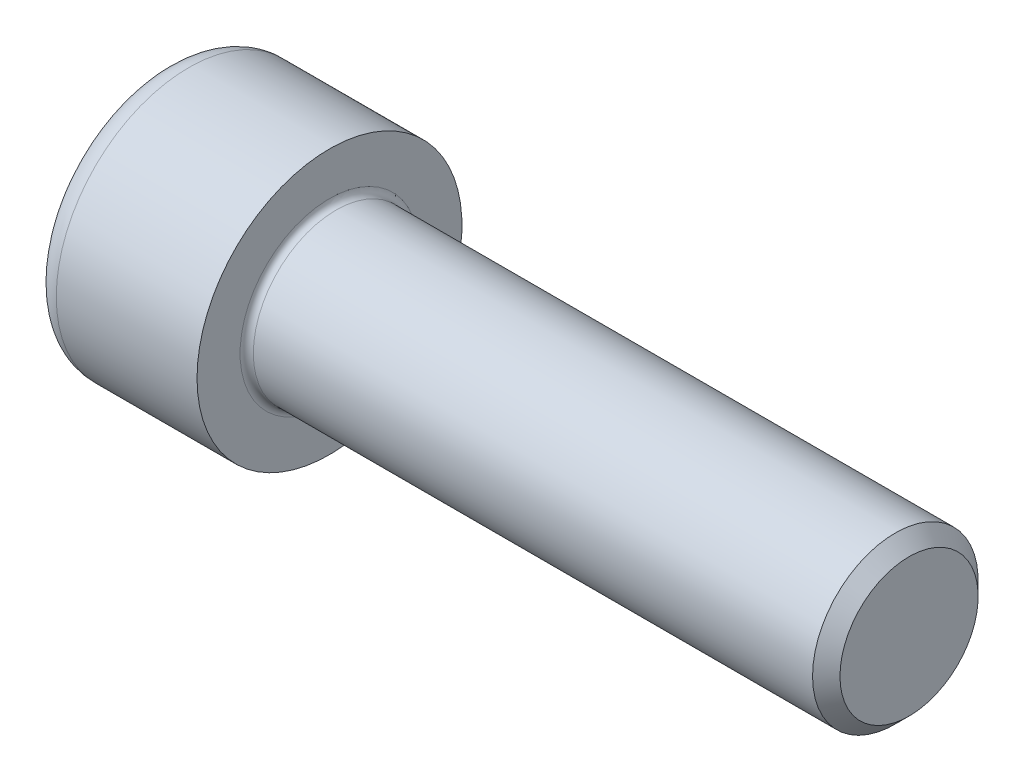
ISO-10303-21;
HEADER;
FILE_DESCRIPTION(('STEP AP214'),'2;1');
FILE_NAME('part.step','',(''),(''),'','','');
FILE_SCHEMA(('AUTOMOTIVE_DESIGN { 1 0 10303 214 1 1 1 1 }'));
ENDSEC;
DATA;
#1=APPLICATION_CONTEXT('core data for automotive mechanical design processes');
#2=APPLICATION_PROTOCOL_DEFINITION('international standard','automotive_design',2000,#1);
#3=PRODUCT_CONTEXT('',#1,'mechanical');
#4=PRODUCT('Part','Part','',(#3));
#5=PRODUCT_RELATED_PRODUCT_CATEGORY('part','',(#4));
#6=PRODUCT_DEFINITION_FORMATION('','',#4);
#7=PRODUCT_DEFINITION_CONTEXT('part definition',#1,'design');
#8=PRODUCT_DEFINITION('design','',#6,#7);
#9=PRODUCT_DEFINITION_SHAPE('','',#8);
#10=(LENGTH_UNIT() NAMED_UNIT(*) SI_UNIT(.MILLI.,.METRE.));
#11=(NAMED_UNIT(*) PLANE_ANGLE_UNIT() SI_UNIT($,.RADIAN.));
#12=(NAMED_UNIT(*) SI_UNIT($,.STERADIAN.) SOLID_ANGLE_UNIT());
#13=UNCERTAINTY_MEASURE_WITH_UNIT(LENGTH_MEASURE(1.E-05),#10,'distance_accuracy_value','');
#14=(GEOMETRIC_REPRESENTATION_CONTEXT(3) GLOBAL_UNCERTAINTY_ASSIGNED_CONTEXT((#13)) GLOBAL_UNIT_ASSIGNED_CONTEXT((#10,
#11,#12)) REPRESENTATION_CONTEXT('',''));
#15=CARTESIAN_POINT('',(0.,0.,0.));
#16=DIRECTION('',(0.,0.,1.));
#17=DIRECTION('',(1.,0.,0.));
#18=AXIS2_PLACEMENT_3D('',#15,#16,#17);
#19=CARTESIAN_POINT('',(0.,0.,0.));
#20=DIRECTION('',(-1.,0.,0.));
#21=DIRECTION('',(0.,0.,1.));
#22=AXIS2_PLACEMENT_3D('',#19,#20,#21);
#23=PLANE('',#22);
#24=DIRECTION('',(0.,-0.499999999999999,0.866025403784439));
#25=VECTOR('',#24,1.);
#26=CARTESIAN_POINT('',(0.,4.68519743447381,0.));
#27=LINE('',#26,#25);
#28=CARTESIAN_POINT('',(0.,4.68519743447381,0.));
#29=VERTEX_POINT('',#28);
#30=CARTESIAN_POINT('',(0.,2.34259871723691,4.05749999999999));
#31=VERTEX_POINT('',#30);
#32=EDGE_CURVE('E115',#29,#31,#27,.T.);
#33=ORIENTED_EDGE('',*,*,#32,.T.);
#34=DIRECTION('',(0.,1.,0.));
#35=VECTOR('',#34,1.);
#36=CARTESIAN_POINT('',(0.,-2.3425987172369,4.0575));
#37=LINE('',#36,#35);
#38=CARTESIAN_POINT('',(0.,-2.3425987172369,4.0575));
#39=VERTEX_POINT('',#38);
#40=EDGE_CURVE('E104',#39,#31,#37,.T.);
#41=ORIENTED_EDGE('',*,*,#40,.F.);
#42=DIRECTION('',(0.,-0.500000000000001,-0.866025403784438));
#43=VECTOR('',#42,1.);
#44=CARTESIAN_POINT('',(0.,-2.3425987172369,4.0575));
#45=LINE('',#44,#43);
#46=CARTESIAN_POINT('',(0.,-4.68519743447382,0.));
#47=VERTEX_POINT('',#46);
#48=EDGE_CURVE('E114',#39,#47,#45,.T.);
#49=ORIENTED_EDGE('',*,*,#48,.T.);
#50=DIRECTION('',(0.,0.499999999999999,-0.866025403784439));
#51=VECTOR('',#50,1.);
#52=CARTESIAN_POINT('',(0.,-4.68519743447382,0.));
#53=LINE('',#52,#51);
#54=CARTESIAN_POINT('',(0.,-2.34259871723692,-4.0575));
#55=VERTEX_POINT('',#54);
#56=EDGE_CURVE('E133',#47,#55,#53,.T.);
#57=ORIENTED_EDGE('',*,*,#56,.T.);
#58=DIRECTION('',(0.,-1.,0.));
#59=VECTOR('',#58,1.);
#60=CARTESIAN_POINT('',(0.,2.3425987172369,-4.05750000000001));
#61=LINE('',#60,#59);
#62=CARTESIAN_POINT('',(0.,2.3425987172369,-4.05750000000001));
#63=VERTEX_POINT('',#62);
#64=EDGE_CURVE('E136',#63,#55,#61,.T.);
#65=ORIENTED_EDGE('',*,*,#64,.F.);
#66=DIRECTION('',(0.,-0.500000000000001,-0.866025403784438));
#67=VECTOR('',#66,1.);
#68=CARTESIAN_POINT('',(0.,4.68519743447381,0.));
#69=LINE('',#68,#67);
#70=EDGE_CURVE('E129',#29,#63,#69,.T.);
#71=ORIENTED_EDGE('',*,*,#70,.F.);
#72=EDGE_LOOP('',(#33,#41,#49,#57,#65,#71));
#73=FACE_BOUND('',#72,.T.);
#74=CARTESIAN_POINT('',(0.,0.,0.));
#75=DIRECTION('',(-1.,0.,0.));
#76=DIRECTION('',(0.,0.,1.));
#77=AXIS2_PLACEMENT_3D('',#74,#75,#76);
#78=CIRCLE('',#77,6.5);
#79=CARTESIAN_POINT('',(0.,0.,6.5));
#80=VERTEX_POINT('',#79);
#81=EDGE_CURVE('E40',#80,#80,#78,.T.);
#82=ORIENTED_EDGE('',*,*,#81,.T.);
#83=EDGE_LOOP('',(#82));
#84=FACE_BOUND('',#83,.T.);
#85=ADVANCED_FACE('F33',(#73,#84),#23,.T.);
#86=CARTESIAN_POINT('',(-31.75,0.,0.));
#87=DIRECTION('',(-1.,0.,0.));
#88=DIRECTION('',(0.,0.,1.));
#89=AXIS2_PLACEMENT_3D('',#86,#87,#88);
#90=CYLINDRICAL_SURFACE('',#89,8.);
#91=CARTESIAN_POINT('',(1.5,0.,0.));
#92=DIRECTION('',(-1.,0.,0.));
#93=DIRECTION('',(0.,0.,1.));
#94=AXIS2_PLACEMENT_3D('',#91,#92,#93);
#95=CIRCLE('',#94,8.);
#96=CARTESIAN_POINT('',(1.5,0.,8.));
#97=VERTEX_POINT('',#96);
#98=EDGE_CURVE('E11',#97,#97,#95,.F.);
#99=ORIENTED_EDGE('',*,*,#98,.T.);
#100=EDGE_LOOP('',(#99));
#101=FACE_BOUND('',#100,.T.);
#102=CARTESIAN_POINT('',(10.,0.,0.));
#103=DIRECTION('',(-1.,0.,0.));
#104=DIRECTION('',(0.,0.,1.));
#105=AXIS2_PLACEMENT_3D('',#102,#103,#104);
#106=CIRCLE('',#105,8.);
#107=CARTESIAN_POINT('',(10.,0.,8.));
#108=VERTEX_POINT('',#107);
#109=EDGE_CURVE('E181',#108,#108,#106,.T.);
#110=ORIENTED_EDGE('',*,*,#109,.T.);
#111=EDGE_LOOP('',(#110));
#112=FACE_BOUND('',#111,.T.);
#113=ADVANCED_FACE('F208',(#101,#112),#90,.T.);
#114=CARTESIAN_POINT('',(10.,8.,0.));
#115=DIRECTION('',(1.,0.,0.));
#116=DIRECTION('',(0.,0.,-1.));
#117=AXIS2_PLACEMENT_3D('',#114,#115,#116);
#118=PLANE('',#117);
#119=CARTESIAN_POINT('',(10.,0.,0.));
#120=DIRECTION('',(1.,0.,0.));
#121=DIRECTION('',(0.,0.,-1.));
#122=AXIS2_PLACEMENT_3D('',#119,#120,#121);
#123=CIRCLE('',#122,5.4);
#124=CARTESIAN_POINT('',(10.,0.,-5.4));
#125=VERTEX_POINT('',#124);
#126=EDGE_CURVE('E184',#125,#125,#123,.F.);
#127=ORIENTED_EDGE('',*,*,#126,.T.);
#128=EDGE_LOOP('',(#127));
#129=FACE_BOUND('',#128,.T.);
#130=ORIENTED_EDGE('',*,*,#109,.F.);
#131=EDGE_LOOP('',(#130));
#132=FACE_BOUND('',#131,.T.);
#133=ADVANCED_FACE('F212',(#129,#132),#118,.T.);
#134=CARTESIAN_POINT('',(-31.75,0.,0.));
#135=DIRECTION('',(-1.,0.,0.));
#136=DIRECTION('',(0.,0.,1.));
#137=AXIS2_PLACEMENT_3D('',#134,#135,#136);
#138=CYLINDRICAL_SURFACE('',#137,5.);
#139=CARTESIAN_POINT('',(10.4,0.,0.));
#140=DIRECTION('',(1.,0.,0.));
#141=DIRECTION('',(0.,0.,-1.));
#142=AXIS2_PLACEMENT_3D('',#139,#140,#141);
#143=CIRCLE('',#142,5.);
#144=CARTESIAN_POINT('',(10.4,0.,-5.));
#145=VERTEX_POINT('',#144);
#146=EDGE_CURVE('E187',#145,#145,#143,.T.);
#147=ORIENTED_EDGE('',*,*,#146,.T.);
#148=EDGE_LOOP('',(#147));
#149=FACE_BOUND('',#148,.T.);
#150=CARTESIAN_POINT('',(44.172,0.,0.));
#151=DIRECTION('',(-1.,0.,0.));
#152=DIRECTION('',(0.,0.,1.));
#153=AXIS2_PLACEMENT_3D('',#150,#151,#152);
#154=CIRCLE('',#153,5.);
#155=CARTESIAN_POINT('',(44.172,0.,5.));
#156=VERTEX_POINT('',#155);
#157=EDGE_CURVE('E178',#156,#156,#154,.T.);
#158=ORIENTED_EDGE('',*,*,#157,.T.);
#159=EDGE_LOOP('',(#158));
#160=FACE_BOUND('',#159,.T.);
#161=ADVANCED_FACE('F217',(#149,#160),#138,.T.);
#162=CARTESIAN_POINT('',(45.,0.,0.));
#163=DIRECTION('',(-1.,0.,0.));
#164=DIRECTION('',(0.,0.,1.));
#165=AXIS2_PLACEMENT_3D('',#162,#163,#164);
#166=CONICAL_SURFACE('',#165,4.172,0.785398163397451);
#167=ORIENTED_EDGE('',*,*,#157,.F.);
#168=EDGE_LOOP('',(#167));
#169=FACE_BOUND('',#168,.T.);
#170=CARTESIAN_POINT('',(45.,0.,0.));
#171=DIRECTION('',(-1.,0.,0.));
#172=DIRECTION('',(0.,0.,1.));
#173=AXIS2_PLACEMENT_3D('',#170,#171,#172);
#174=CIRCLE('',#173,4.172);
#175=CARTESIAN_POINT('',(45.,0.,4.172));
#176=VERTEX_POINT('',#175);
#177=EDGE_CURVE('E174',#176,#176,#174,.T.);
#178=ORIENTED_EDGE('',*,*,#177,.T.);
#179=EDGE_LOOP('',(#178));
#180=FACE_BOUND('',#179,.T.);
#181=ADVANCED_FACE('F224',(#169,#180),#166,.T.);
#182=CARTESIAN_POINT('',(45.,4.172,0.));
#183=DIRECTION('',(1.,0.,0.));
#184=DIRECTION('',(0.,0.,-1.));
#185=AXIS2_PLACEMENT_3D('',#182,#183,#184);
#186=PLANE('',#185);
#187=ORIENTED_EDGE('',*,*,#177,.F.);
#188=EDGE_LOOP('',(#187));
#189=FACE_BOUND('',#188,.T.);
#190=ADVANCED_FACE('F202',(#189),#186,.T.);
#191=CARTESIAN_POINT('',(10.4,0.,0.));
#192=DIRECTION('',(1.,0.,0.));
#193=DIRECTION('',(0.,0.,-1.));
#194=AXIS2_PLACEMENT_3D('',#191,#192,#193);
#195=TOROIDAL_SURFACE('',#194,5.4,0.4);
#196=ORIENTED_EDGE('',*,*,#146,.F.);
#197=EDGE_LOOP('',(#196));
#198=FACE_BOUND('',#197,.T.);
#199=ORIENTED_EDGE('',*,*,#126,.F.);
#200=EDGE_LOOP('',(#199));
#201=FACE_BOUND('',#200,.T.);
#202=ADVANCED_FACE('F194',(#198,#201),#195,.F.);
#203=CARTESIAN_POINT('',(1.5,0.,0.));
#204=DIRECTION('',(-1.,0.,0.));
#205=DIRECTION('',(0.,0.,1.));
#206=AXIS2_PLACEMENT_3D('',#203,#204,#205);
#207=TOROIDAL_SURFACE('',#206,6.5,1.5);
#208=ORIENTED_EDGE('',*,*,#98,.F.);
#209=EDGE_LOOP('',(#208));
#210=FACE_BOUND('',#209,.T.);
#211=ORIENTED_EDGE('',*,*,#81,.F.);
#212=EDGE_LOOP('',(#211));
#213=FACE_BOUND('',#212,.T.);
#214=ADVANCED_FACE('F192',(#210,#213),#207,.T.);
#215=CARTESIAN_POINT('',(5.,4.68519743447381,0.));
#216=DIRECTION('',(0.,-0.866025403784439,-0.499999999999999));
#217=DIRECTION('',(0.,0.499999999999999,-0.866025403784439));
#218=AXIS2_PLACEMENT_3D('',#215,#216,#217);
#219=PLANE('',#218);
#220=ORIENTED_EDGE('',*,*,#32,.F.);
#221=DIRECTION('',(-1.,0.,0.));
#222=VECTOR('',#221,1.);
#223=CARTESIAN_POINT('',(5.,4.68519743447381,0.));
#224=LINE('',#223,#222);
#225=CARTESIAN_POINT('',(5.,4.68519743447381,0.));
#226=VERTEX_POINT('',#225);
#227=EDGE_CURVE('E159',#226,#29,#224,.T.);
#228=ORIENTED_EDGE('',*,*,#227,.F.);
#229=DIRECTION('',(0.,-0.499999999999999,0.866025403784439));
#230=VECTOR('',#229,1.);
#231=CARTESIAN_POINT('',(5.,4.68519743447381,0.));
#232=LINE('',#231,#230);
#233=CARTESIAN_POINT('',(5.,3.51389807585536,2.02874999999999));
#234=VERTEX_POINT('',#233);
#235=EDGE_CURVE('E139',#226,#234,#232,.T.);
#236=ORIENTED_EDGE('',*,*,#235,.T.);
#237=CARTESIAN_POINT('',(5.,2.34259871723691,4.05749999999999));
#238=VERTEX_POINT('',#237);
#239=EDGE_CURVE('E123',#234,#238,#232,.T.);
#240=ORIENTED_EDGE('',*,*,#239,.T.);
#241=DIRECTION('',(-1.,0.,0.));
#242=VECTOR('',#241,1.);
#243=CARTESIAN_POINT('',(5.,2.34259871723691,4.05749999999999));
#244=LINE('',#243,#242);
#245=EDGE_CURVE('E108',#238,#31,#244,.T.);
#246=ORIENTED_EDGE('',*,*,#245,.T.);
#247=EDGE_LOOP('',(#220,#228,#236,#240,#246));
#248=FACE_BOUND('',#247,.T.);
#249=ADVANCED_FACE('F119',(#248),#219,.T.);
#250=CARTESIAN_POINT('',(5.,-2.3425987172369,4.0575));
#251=DIRECTION('',(0.,0.,1.));
#252=DIRECTION('',(0.,-1.,0.));
#253=AXIS2_PLACEMENT_3D('',#250,#251,#252);
#254=PLANE('',#253);
#255=ORIENTED_EDGE('',*,*,#40,.T.);
#256=ORIENTED_EDGE('',*,*,#245,.F.);
#257=DIRECTION('',(0.,1.,0.));
#258=VECTOR('',#257,1.);
#259=CARTESIAN_POINT('',(5.,-2.3425987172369,4.0575));
#260=LINE('',#259,#258);
#261=CARTESIAN_POINT('',(5.,0.,4.0575));
#262=VERTEX_POINT('',#261);
#263=EDGE_CURVE('E141',#262,#238,#260,.T.);
#264=ORIENTED_EDGE('',*,*,#263,.F.);
#265=CARTESIAN_POINT('',(5.,-2.3425987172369,4.0575));
#266=VERTEX_POINT('',#265);
#267=EDGE_CURVE('E142',#266,#262,#260,.T.);
#268=ORIENTED_EDGE('',*,*,#267,.F.);
#269=DIRECTION('',(-1.,0.,0.));
#270=VECTOR('',#269,1.);
#271=CARTESIAN_POINT('',(5.,-2.3425987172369,4.0575));
#272=LINE('',#271,#270);
#273=EDGE_CURVE('E110',#266,#39,#272,.T.);
#274=ORIENTED_EDGE('',*,*,#273,.T.);
#275=EDGE_LOOP('',(#255,#256,#264,#268,#274));
#276=FACE_BOUND('',#275,.T.);
#277=ADVANCED_FACE('F106',(#276),#254,.F.);
#278=CARTESIAN_POINT('',(5.,-2.3425987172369,4.0575));
#279=DIRECTION('',(0.,0.866025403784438,-0.500000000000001));
#280=DIRECTION('',(0.,0.500000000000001,0.866025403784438));
#281=AXIS2_PLACEMENT_3D('',#278,#279,#280);
#282=PLANE('',#281);
#283=ORIENTED_EDGE('',*,*,#48,.F.);
#284=ORIENTED_EDGE('',*,*,#273,.F.);
#285=DIRECTION('',(0.,-0.500000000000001,-0.866025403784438));
#286=VECTOR('',#285,1.);
#287=CARTESIAN_POINT('',(5.,-2.3425987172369,4.0575));
#288=LINE('',#287,#286);
#289=CARTESIAN_POINT('',(5.,-3.51389807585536,2.02875));
#290=VERTEX_POINT('',#289);
#291=EDGE_CURVE('E146',#266,#290,#288,.T.);
#292=ORIENTED_EDGE('',*,*,#291,.T.);
#293=CARTESIAN_POINT('',(5.,-4.68519743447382,0.));
#294=VERTEX_POINT('',#293);
#295=EDGE_CURVE('E145',#290,#294,#288,.T.);
#296=ORIENTED_EDGE('',*,*,#295,.T.);
#297=DIRECTION('',(-1.,0.,0.));
#298=VECTOR('',#297,1.);
#299=CARTESIAN_POINT('',(5.,-4.68519743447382,0.));
#300=LINE('',#299,#298);
#301=EDGE_CURVE('E167',#294,#47,#300,.T.);
#302=ORIENTED_EDGE('',*,*,#301,.T.);
#303=EDGE_LOOP('',(#283,#284,#292,#296,#302));
#304=FACE_BOUND('',#303,.T.);
#305=ADVANCED_FACE('F274',(#304),#282,.T.);
#306=CARTESIAN_POINT('',(5.,-4.68519743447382,0.));
#307=DIRECTION('',(0.,0.866025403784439,0.499999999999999));
#308=DIRECTION('',(0.,-0.499999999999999,0.866025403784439));
#309=AXIS2_PLACEMENT_3D('',#306,#307,#308);
#310=PLANE('',#309);
#311=ORIENTED_EDGE('',*,*,#56,.F.);
#312=ORIENTED_EDGE('',*,*,#301,.F.);
#313=DIRECTION('',(0.,0.499999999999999,-0.866025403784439));
#314=VECTOR('',#313,1.);
#315=CARTESIAN_POINT('',(5.,-4.68519743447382,0.));
#316=LINE('',#315,#314);
#317=CARTESIAN_POINT('',(5.,-3.51389807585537,-2.02875));
#318=VERTEX_POINT('',#317);
#319=EDGE_CURVE('E150',#294,#318,#316,.T.);
#320=ORIENTED_EDGE('',*,*,#319,.T.);
#321=CARTESIAN_POINT('',(5.,-2.34259871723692,-4.0575));
#322=VERTEX_POINT('',#321);
#323=EDGE_CURVE('E149',#318,#322,#316,.T.);
#324=ORIENTED_EDGE('',*,*,#323,.T.);
#325=DIRECTION('',(-1.,0.,0.));
#326=VECTOR('',#325,1.);
#327=CARTESIAN_POINT('',(5.,-2.34259871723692,-4.0575));
#328=LINE('',#327,#326);
#329=EDGE_CURVE('E164',#322,#55,#328,.T.);
#330=ORIENTED_EDGE('',*,*,#329,.T.);
#331=EDGE_LOOP('',(#311,#312,#320,#324,#330));
#332=FACE_BOUND('',#331,.T.);
#333=ADVANCED_FACE('F283',(#332),#310,.T.);
#334=CARTESIAN_POINT('',(5.,2.3425987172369,-4.05750000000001));
#335=DIRECTION('',(0.,0.,-1.));
#336=DIRECTION('',(0.,1.,0.));
#337=AXIS2_PLACEMENT_3D('',#334,#335,#336);
#338=PLANE('',#337);
#339=ORIENTED_EDGE('',*,*,#64,.T.);
#340=ORIENTED_EDGE('',*,*,#329,.F.);
#341=DIRECTION('',(0.,-1.,0.));
#342=VECTOR('',#341,1.);
#343=CARTESIAN_POINT('',(5.,2.3425987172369,-4.05750000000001));
#344=LINE('',#343,#342);
#345=CARTESIAN_POINT('',(5.,0.,-4.0575));
#346=VERTEX_POINT('',#345);
#347=EDGE_CURVE('E153',#346,#322,#344,.T.);
#348=ORIENTED_EDGE('',*,*,#347,.F.);
#349=CARTESIAN_POINT('',(5.,2.3425987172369,-4.05750000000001));
#350=VERTEX_POINT('',#349);
#351=EDGE_CURVE('E47',#350,#346,#344,.T.);
#352=ORIENTED_EDGE('',*,*,#351,.F.);
#353=DIRECTION('',(-1.,0.,0.));
#354=VECTOR('',#353,1.);
#355=CARTESIAN_POINT('',(5.,2.3425987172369,-4.05750000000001));
#356=LINE('',#355,#354);
#357=EDGE_CURVE('E161',#350,#63,#356,.T.);
#358=ORIENTED_EDGE('',*,*,#357,.T.);
#359=EDGE_LOOP('',(#339,#340,#348,#352,#358));
#360=FACE_BOUND('',#359,.T.);
#361=ADVANCED_FACE('F293',(#360),#338,.F.);
#362=CARTESIAN_POINT('',(5.,4.68519743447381,0.));
#363=DIRECTION('',(0.,0.866025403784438,-0.500000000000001));
#364=DIRECTION('',(0.,0.500000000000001,0.866025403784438));
#365=AXIS2_PLACEMENT_3D('',#362,#363,#364);
#366=PLANE('',#365);
#367=ORIENTED_EDGE('',*,*,#70,.T.);
#368=ORIENTED_EDGE('',*,*,#357,.F.);
#369=DIRECTION('',(0.,-0.500000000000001,-0.866025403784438));
#370=VECTOR('',#369,1.);
#371=CARTESIAN_POINT('',(5.,4.68519743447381,0.));
#372=LINE('',#371,#370);
#373=CARTESIAN_POINT('',(5.,3.51389807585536,-2.02875));
#374=VERTEX_POINT('',#373);
#375=EDGE_CURVE('E155',#374,#350,#372,.T.);
#376=ORIENTED_EDGE('',*,*,#375,.F.);
#377=EDGE_CURVE('E156',#226,#374,#372,.T.);
#378=ORIENTED_EDGE('',*,*,#377,.F.);
#379=ORIENTED_EDGE('',*,*,#227,.T.);
#380=EDGE_LOOP('',(#367,#368,#376,#378,#379));
#381=FACE_BOUND('',#380,.T.);
#382=ADVANCED_FACE('F303',(#381),#366,.F.);
#383=CARTESIAN_POINT('',(5.,4.68519743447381,0.));
#384=DIRECTION('',(1.,0.,0.));
#385=DIRECTION('',(0.,0.,-1.));
#386=AXIS2_PLACEMENT_3D('',#383,#384,#385);
#387=PLANE('',#386);
#388=ORIENTED_EDGE('',*,*,#347,.T.);
#389=ORIENTED_EDGE('',*,*,#323,.F.);
#390=CARTESIAN_POINT('',(5.,0.,0.));
#391=DIRECTION('',(-1.,0.,0.));
#392=DIRECTION('',(0.,0.,1.));
#393=AXIS2_PLACEMENT_3D('',#390,#391,#392);
#394=CIRCLE('',#393,4.0575);
#395=EDGE_CURVE('E389',#346,#318,#394,.T.);
#396=ORIENTED_EDGE('',*,*,#395,.F.);
#397=EDGE_LOOP('',(#388,#389,#396));
#398=FACE_BOUND('',#397,.T.);
#399=ADVANCED_FACE('F313',(#398),#387,.F.);
#400=ORIENTED_EDGE('',*,*,#319,.F.);
#401=ORIENTED_EDGE('',*,*,#295,.F.);
#402=EDGE_CURVE('E387',#318,#290,#394,.T.);
#403=ORIENTED_EDGE('',*,*,#402,.F.);
#404=EDGE_LOOP('',(#400,#401,#403));
#405=FACE_BOUND('',#404,.T.);
#406=ADVANCED_FACE('F323',(#405),#387,.F.);
#407=ORIENTED_EDGE('',*,*,#291,.F.);
#408=ORIENTED_EDGE('',*,*,#267,.T.);
#409=EDGE_CURVE('E124',#290,#262,#394,.T.);
#410=ORIENTED_EDGE('',*,*,#409,.F.);
#411=EDGE_LOOP('',(#407,#408,#410));
#412=FACE_BOUND('',#411,.T.);
#413=ADVANCED_FACE('F334',(#412),#387,.F.);
#414=ORIENTED_EDGE('',*,*,#263,.T.);
#415=ORIENTED_EDGE('',*,*,#239,.F.);
#416=EDGE_CURVE('E171',#262,#234,#394,.T.);
#417=ORIENTED_EDGE('',*,*,#416,.F.);
#418=EDGE_LOOP('',(#414,#415,#417));
#419=FACE_BOUND('',#418,.T.);
#420=ADVANCED_FACE('F343',(#419),#387,.F.);
#421=ORIENTED_EDGE('',*,*,#235,.F.);
#422=ORIENTED_EDGE('',*,*,#377,.T.);
#423=EDGE_CURVE('E175',#234,#374,#394,.T.);
#424=ORIENTED_EDGE('',*,*,#423,.F.);
#425=EDGE_LOOP('',(#421,#422,#424));
#426=FACE_BOUND('',#425,.T.);
#427=ADVANCED_FACE('F352',(#426),#387,.F.);
#428=ORIENTED_EDGE('',*,*,#375,.T.);
#429=ORIENTED_EDGE('',*,*,#351,.T.);
#430=EDGE_CURVE('E392',#374,#346,#394,.T.);
#431=ORIENTED_EDGE('',*,*,#430,.F.);
#432=EDGE_LOOP('',(#428,#429,#431));
#433=FACE_BOUND('',#432,.T.);
#434=ADVANCED_FACE('F326',(#433),#387,.F.);
#435=CARTESIAN_POINT('',(5.,0.,0.));
#436=DIRECTION('',(-1.,0.,0.));
#437=DIRECTION('',(0.,0.,1.));
#438=AXIS2_PLACEMENT_3D('',#435,#436,#437);
#439=CONICAL_SURFACE('',#438,4.0575,1.04719755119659);
#440=CARTESIAN_POINT('',(7.34259871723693,0.,0.));
#441=VERTEX_POINT('',#440);
#442=VERTEX_LOOP('',#441);
#443=FACE_BOUND('',#442,.T.);
#444=ORIENTED_EDGE('',*,*,#416,.T.);
#445=ORIENTED_EDGE('',*,*,#423,.T.);
#446=ORIENTED_EDGE('',*,*,#430,.T.);
#447=ORIENTED_EDGE('',*,*,#395,.T.);
#448=ORIENTED_EDGE('',*,*,#402,.T.);
#449=ORIENTED_EDGE('',*,*,#409,.T.);
#450=EDGE_LOOP('',(#444,#445,#446,#447,#448,#449));
#451=FACE_BOUND('',#450,.T.);
#452=ADVANCED_FACE('F369',(#443,#451),#439,.F.);
#453=CLOSED_SHELL('',(#85,#113,#133,#161,#181,#190,#202,#214,#249,#277,#305,#333,#361,#382,#399,
#406,#413,#420,#427,#434,#452));
#454=MANIFOLD_SOLID_BREP('B2',#453);
#455=ADVANCED_BREP_SHAPE_REPRESENTATION('',(#18,#454),#14);
#456=SHAPE_DEFINITION_REPRESENTATION(#9,#455);
ENDSEC;
END-ISO-10303-21;
